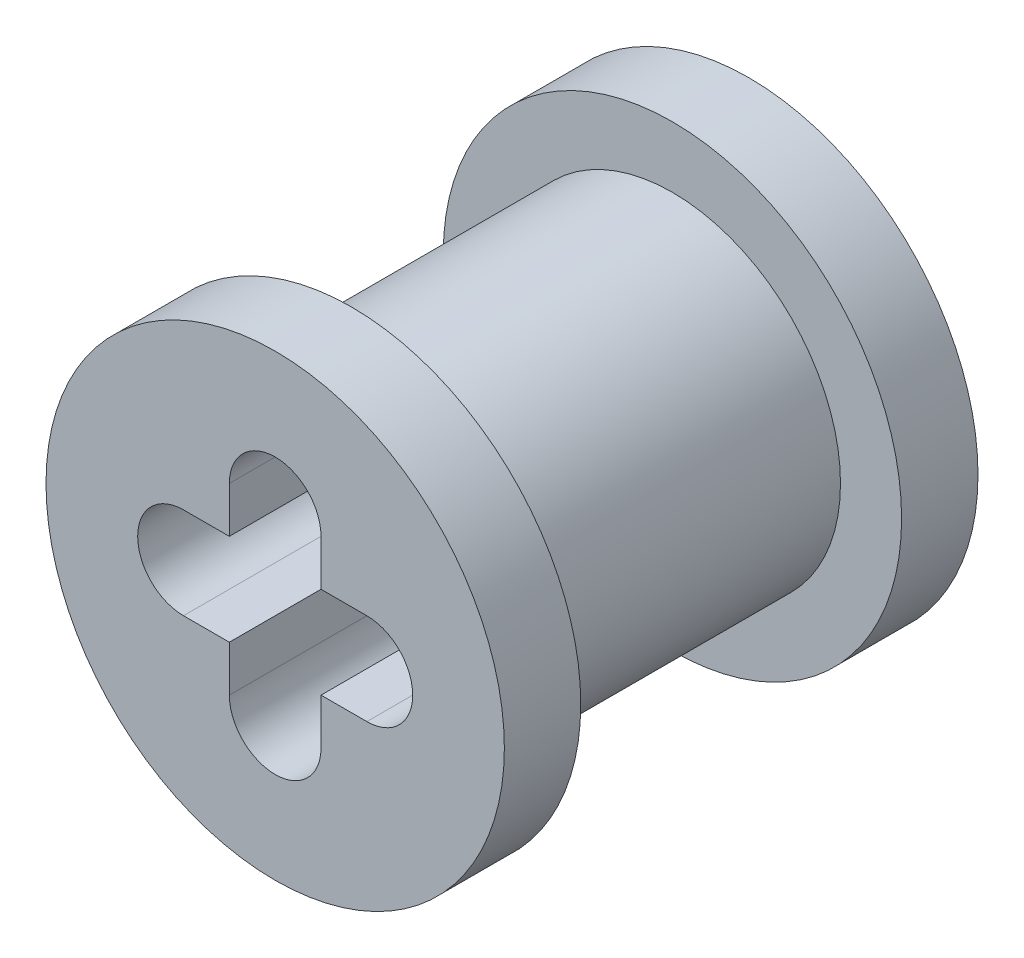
from build123d import *

# Parameters (mm, degrees)
SKETCH1_R           = 2.794
BOSS_EXTRUDE1_DEPTH = 3.937
SKETCH2_R           = 3.81
SKETCH2_R_2         = 2.794
BOSS_EXTRUDE2_DEPTH = 1.27


with BuildPart() as part:
    # Sketch1 → Boss-Extrude1 (new body)
    with BuildSketch(Plane.XY):
        with Locations((7.874, 0)):
            Circle(SKETCH1_R)
        with BuildLine():
            Line((6.35, 0.762), (7.112, 0.762))
            Line((7.112, 0.762), (7.112, 1.524))
            ThreePointArc((7.112, 1.524), (7.874, 2.286), (8.636, 1.524))
            Line((8.636, 1.524), (8.636, 0.762))
            Line((8.636, 0.762), (9.398, 0.762))
            ThreePointArc((9.398, 0.762), (10.16, 0), (9.398, -0.762))
            Line((9.398, -0.762), (8.636, -0.762))
            Line((8.636, -0.762), (8.636, -1.524))
            ThreePointArc((8.636, -1.524), (7.874, -2.286), (7.112, -1.524))
            Line((7.112, -1.524), (7.112, -0.762))
            Line((7.112, -0.762), (6.35, -0.762))
            ThreePointArc((6.35, -0.762), (5.588, 0), (6.35, 0.762))
        make_face(mode=Mode.SUBTRACT)
    boss_extrude1 = extrude(amount=BOSS_EXTRUDE1_DEPTH)

    # Sketch2 → Boss-Extrude2 (add)
    with BuildSketch(Plane(origin=(0, 0, 0), x_dir=(-1, 0, 0), z_dir=(0, 0, -1))):
        with Locations((-7.874, 0)):
            Circle(SKETCH2_R)
        with Locations((-7.874, 0)):
            Circle(SKETCH2_R_2, mode=Mode.SUBTRACT)
    boss_extrude2 = extrude(amount=-BOSS_EXTRUDE2_DEPTH)

    # Mirror1: Boss-Extrude1, Boss-Extrude2 across plane
    add(boss_extrude1.mirror(Plane.XY.offset(3.937)))
    add(boss_extrude2.mirror(Plane.XY.offset(3.937)))


solid = part.part
